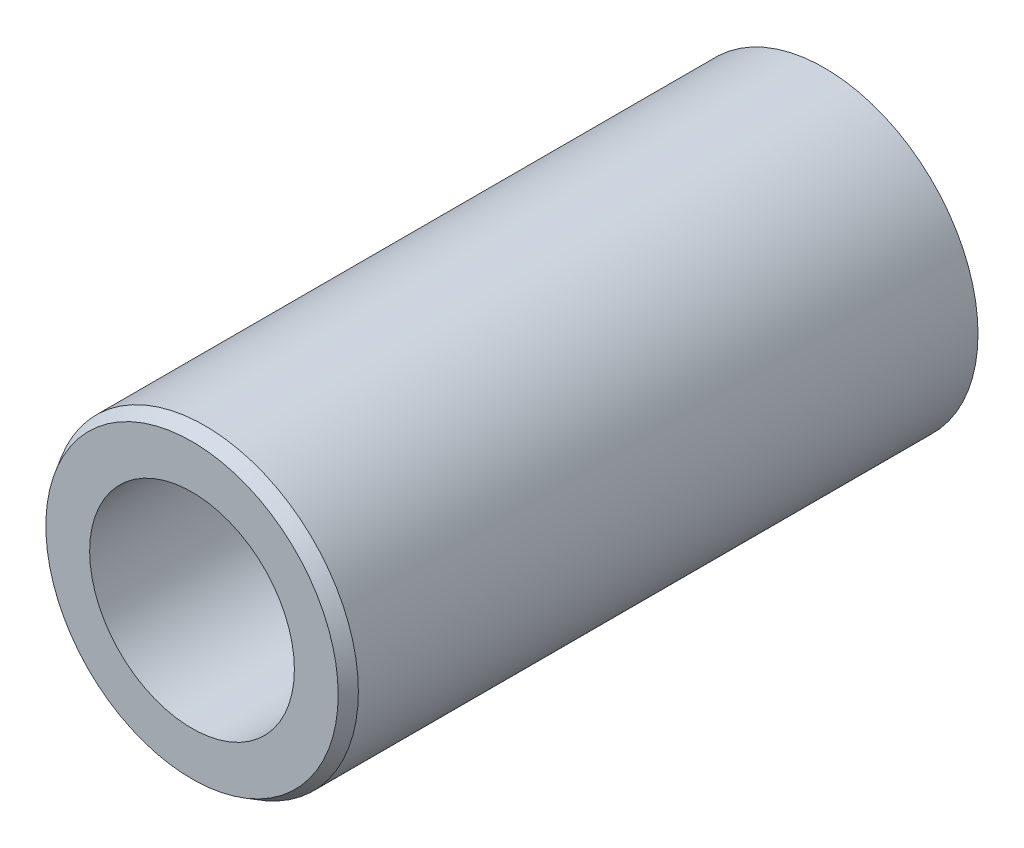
ISO-10303-21;
HEADER;
FILE_DESCRIPTION(('STEP AP214'),'2;1');
FILE_NAME('part.step','',(''),(''),'','','');
FILE_SCHEMA(('AUTOMOTIVE_DESIGN { 1 0 10303 214 1 1 1 1 }'));
ENDSEC;
DATA;
#1=APPLICATION_CONTEXT('core data for automotive mechanical design processes');
#2=APPLICATION_PROTOCOL_DEFINITION('international standard','automotive_design',2000,#1);
#3=PRODUCT_CONTEXT('',#1,'mechanical');
#4=PRODUCT('Part','Part','',(#3));
#5=PRODUCT_RELATED_PRODUCT_CATEGORY('part','',(#4));
#6=PRODUCT_DEFINITION_FORMATION('','',#4);
#7=PRODUCT_DEFINITION_CONTEXT('part definition',#1,'design');
#8=PRODUCT_DEFINITION('design','',#6,#7);
#9=PRODUCT_DEFINITION_SHAPE('','',#8);
#10=(LENGTH_UNIT() NAMED_UNIT(*) SI_UNIT(.MILLI.,.METRE.));
#11=(NAMED_UNIT(*) PLANE_ANGLE_UNIT() SI_UNIT($,.RADIAN.));
#12=(NAMED_UNIT(*) SI_UNIT($,.STERADIAN.) SOLID_ANGLE_UNIT());
#13=UNCERTAINTY_MEASURE_WITH_UNIT(LENGTH_MEASURE(1.E-05),#10,'distance_accuracy_value','');
#14=(GEOMETRIC_REPRESENTATION_CONTEXT(3) GLOBAL_UNCERTAINTY_ASSIGNED_CONTEXT((#13)) GLOBAL_UNIT_ASSIGNED_CONTEXT((#10,
#11,#12)) REPRESENTATION_CONTEXT('',''));
#15=CARTESIAN_POINT('',(0.,0.,0.));
#16=DIRECTION('',(0.,0.,1.));
#17=DIRECTION('',(1.,0.,0.));
#18=AXIS2_PLACEMENT_3D('',#15,#16,#17);
#19=CARTESIAN_POINT('',(0.,0.,12.5));
#20=DIRECTION('',(0.,0.,1.));
#21=DIRECTION('',(1.,0.,0.));
#22=AXIS2_PLACEMENT_3D('',#19,#20,#21);
#23=PLANE('',#22);
#24=CARTESIAN_POINT('',(0.,0.,12.5));
#25=DIRECTION('',(0.,0.,1.));
#26=DIRECTION('',(1.,0.,0.));
#27=AXIS2_PLACEMENT_3D('',#24,#25,#26);
#28=CIRCLE('',#27,5.71132486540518);
#29=CARTESIAN_POINT('',(5.71132486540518,0.,12.5));
#30=VERTEX_POINT('',#29);
#31=EDGE_CURVE('E10',#30,#30,#28,.T.);
#32=ORIENTED_EDGE('',*,*,#31,.T.);
#33=EDGE_LOOP('',(#32));
#34=FACE_BOUND('',#33,.T.);
#35=CARTESIAN_POINT('',(0.,0.,12.5));
#36=DIRECTION('',(0.,0.,1.));
#37=DIRECTION('',(1.,0.,0.));
#38=AXIS2_PLACEMENT_3D('',#35,#36,#37);
#39=CIRCLE('',#38,4.);
#40=CARTESIAN_POINT('',(4.,0.,12.5));
#41=VERTEX_POINT('',#40);
#42=EDGE_CURVE('E50',#41,#41,#39,.T.);
#43=ORIENTED_EDGE('',*,*,#42,.F.);
#44=EDGE_LOOP('',(#43));
#45=FACE_BOUND('',#44,.T.);
#46=ADVANCED_FACE('F30',(#34,#45),#23,.T.);
#47=CARTESIAN_POINT('',(0.,0.,-12.5));
#48=DIRECTION('',(0.,0.,1.));
#49=DIRECTION('',(1.,0.,0.));
#50=AXIS2_PLACEMENT_3D('',#47,#48,#49);
#51=PLANE('',#50);
#52=CARTESIAN_POINT('',(0.,0.,-12.5));
#53=DIRECTION('',(0.,0.,1.));
#54=DIRECTION('',(1.,0.,0.));
#55=AXIS2_PLACEMENT_3D('',#52,#53,#54);
#56=CIRCLE('',#55,5.50000000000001);
#57=CARTESIAN_POINT('',(5.50000000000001,0.,-12.5));
#58=VERTEX_POINT('',#57);
#59=EDGE_CURVE('E37',#58,#58,#56,.F.);
#60=ORIENTED_EDGE('',*,*,#59,.T.);
#61=EDGE_LOOP('',(#60));
#62=FACE_BOUND('',#61,.T.);
#63=CARTESIAN_POINT('',(0.,0.,-12.5));
#64=DIRECTION('',(0.,0.,1.));
#65=DIRECTION('',(1.,0.,0.));
#66=AXIS2_PLACEMENT_3D('',#63,#64,#65);
#67=CIRCLE('',#66,4.);
#68=CARTESIAN_POINT('',(4.,0.,-12.5));
#69=VERTEX_POINT('',#68);
#70=EDGE_CURVE('E51',#69,#69,#67,.T.);
#71=ORIENTED_EDGE('',*,*,#70,.T.);
#72=EDGE_LOOP('',(#71));
#73=FACE_BOUND('',#72,.T.);
#74=ADVANCED_FACE('F61',(#62,#73),#51,.F.);
#75=CARTESIAN_POINT('',(0.,0.,12.5));
#76=DIRECTION('',(0.,0.,-1.));
#77=DIRECTION('',(-1.,0.,0.));
#78=AXIS2_PLACEMENT_3D('',#75,#76,#77);
#79=CYLINDRICAL_SURFACE('',#78,6.);
#80=CARTESIAN_POINT('',(0.,0.,-12.2113248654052));
#81=DIRECTION('',(0.,0.,1.));
#82=DIRECTION('',(1.,0.,0.));
#83=AXIS2_PLACEMENT_3D('',#80,#81,#82);
#84=CIRCLE('',#83,6.);
#85=CARTESIAN_POINT('',(6.,0.,-12.2113248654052));
#86=VERTEX_POINT('',#85);
#87=EDGE_CURVE('E41',#86,#86,#84,.T.);
#88=ORIENTED_EDGE('',*,*,#87,.T.);
#89=EDGE_LOOP('',(#88));
#90=FACE_BOUND('',#89,.T.);
#91=CARTESIAN_POINT('',(0.,0.,12.));
#92=DIRECTION('',(0.,0.,1.));
#93=DIRECTION('',(1.,0.,0.));
#94=AXIS2_PLACEMENT_3D('',#91,#92,#93);
#95=CIRCLE('',#94,6.);
#96=CARTESIAN_POINT('',(6.,0.,12.));
#97=VERTEX_POINT('',#96);
#98=EDGE_CURVE('E45',#97,#97,#95,.F.);
#99=ORIENTED_EDGE('',*,*,#98,.T.);
#100=EDGE_LOOP('',(#99));
#101=FACE_BOUND('',#100,.T.);
#102=ADVANCED_FACE('F66',(#90,#101),#79,.T.);
#103=CARTESIAN_POINT('',(0.,0.,12.5));
#104=DIRECTION('',(0.,0.,-1.));
#105=DIRECTION('',(-1.,0.,0.));
#106=AXIS2_PLACEMENT_3D('',#103,#104,#105);
#107=CYLINDRICAL_SURFACE('',#106,4.);
#108=ORIENTED_EDGE('',*,*,#42,.T.);
#109=EDGE_LOOP('',(#108));
#110=FACE_BOUND('',#109,.T.);
#111=ORIENTED_EDGE('',*,*,#70,.F.);
#112=EDGE_LOOP('',(#111));
#113=FACE_BOUND('',#112,.T.);
#114=ADVANCED_FACE('F57',(#110,#113),#107,.F.);
#115=CARTESIAN_POINT('',(0.,0.,-12.2113248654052));
#116=DIRECTION('',(0.,0.,1.));
#117=DIRECTION('',(1.,0.,0.));
#118=AXIS2_PLACEMENT_3D('',#115,#116,#117);
#119=CONICAL_SURFACE('',#118,6.,1.0471975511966);
#120=ORIENTED_EDGE('',*,*,#59,.F.);
#121=EDGE_LOOP('',(#120));
#122=FACE_BOUND('',#121,.T.);
#123=ORIENTED_EDGE('',*,*,#87,.F.);
#124=EDGE_LOOP('',(#123));
#125=FACE_BOUND('',#124,.T.);
#126=ADVANCED_FACE('F72',(#122,#125),#119,.T.);
#127=CARTESIAN_POINT('',(0.,0.,12.5));
#128=DIRECTION('',(0.,0.,-1.));
#129=DIRECTION('',(-1.,0.,0.));
#130=AXIS2_PLACEMENT_3D('',#127,#128,#129);
#131=CONICAL_SURFACE('',#130,5.71132486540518,0.523598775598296);
#132=ORIENTED_EDGE('',*,*,#98,.F.);
#133=EDGE_LOOP('',(#132));
#134=FACE_BOUND('',#133,.T.);
#135=ORIENTED_EDGE('',*,*,#31,.F.);
#136=EDGE_LOOP('',(#135));
#137=FACE_BOUND('',#136,.T.);
#138=ADVANCED_FACE('F32',(#134,#137),#131,.T.);
#139=CLOSED_SHELL('',(#46,#74,#102,#114,#126,#138));
#140=MANIFOLD_SOLID_BREP('B2',#139);
#141=ADVANCED_BREP_SHAPE_REPRESENTATION('',(#18,#140),#14);
#142=SHAPE_DEFINITION_REPRESENTATION(#9,#141);
ENDSEC;
END-ISO-10303-21;
